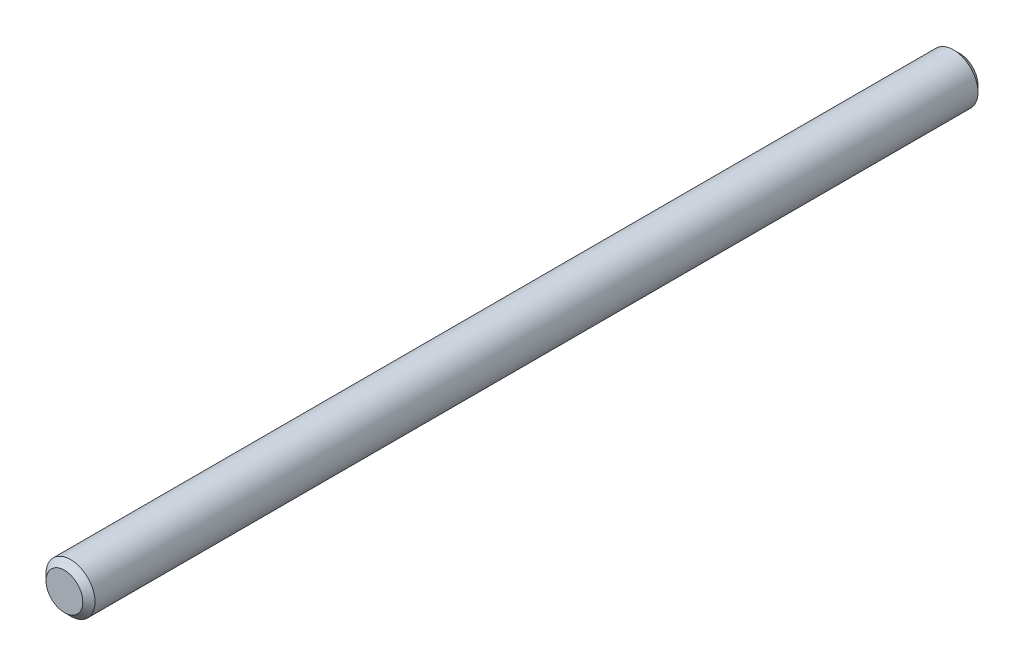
from build123d import *

# Parameters (mm, degrees)
ESQUISSE1_R          = 2
BASE_EXTRUSION_DEPTH = 73
CHANFREIN1_SIZE      = 0.5


with BuildPart() as part:
    # Esquisse1 → Base-Extrusion (new body)
    with BuildSketch(Plane.XY):
        with Locations((12, 12)):
            Circle(ESQUISSE1_R)
    extrude(amount=-BASE_EXTRUSION_DEPTH)

    # Chanfrein1
    chanfrein1_edges = [part.edges().sort_by_distance(p)[0] for p in [
        (10, 12, 0),
        (10, 12, -73),
    ]]
    chamfer(chanfrein1_edges, length=CHANFREIN1_SIZE)


solid = part.part
